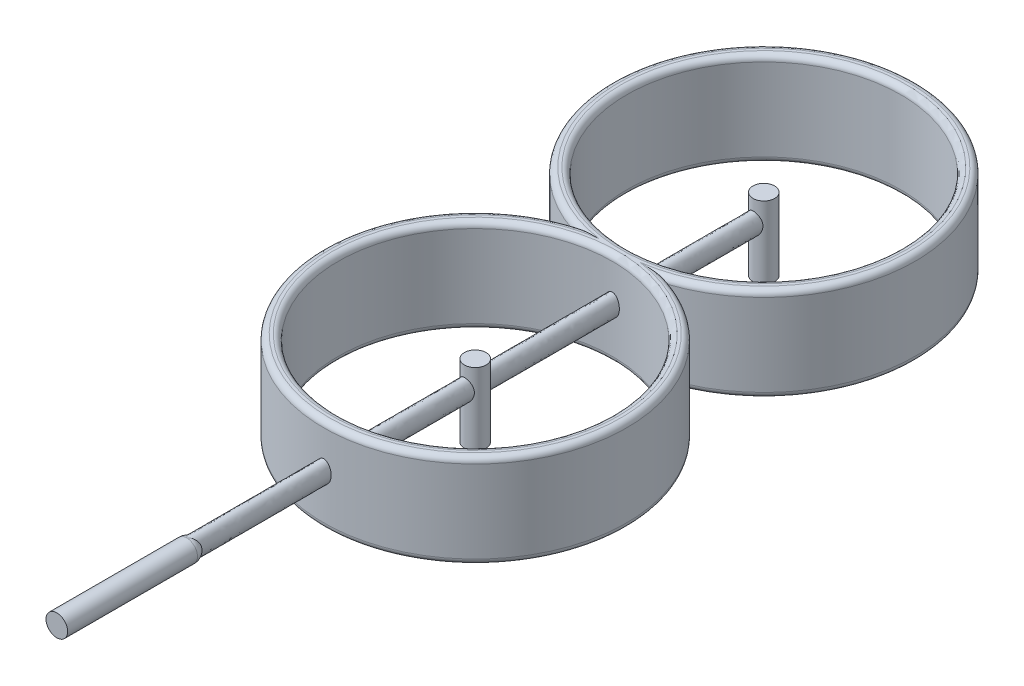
from build123d import *

# Parameters (mm, degrees)
SKETCH1_W           = 40
SKETCH1_H           = 60
BOSS_EXTRUDE1_DEPTH = 70
SKETCH2_R           = 7.5
BOSS_EXTRUDE2_DEPTH = 90
SKETCH3_RX          = 7.5
SKETCH3_RY          = 5
BOSS_EXTRUDE3_DEPTH = 400
SKETCH5_R           = 7.5
BOSS_EXTRUDE4_DEPTH = 50
SKETCH7_W           = 70
SKETCH7_H           = 60
CUT_EXTRUDE1_DEPTH  = 613.00490207


with BuildPart() as part:
    # Sketch1 → Boss-Extrude1 (new body)
    with BuildSketch(Plane.XY):
        with Locations((0, 30)):
            Rectangle(SKETCH1_W, SKETCH1_H)
    extrude(amount=BOSS_EXTRUDE1_DEPTH)

    # Sketch2 → Boss-Extrude2 (add)
    with BuildSketch(Plane(origin=(0, 0, 0), x_dir=(-1, 0, 0), z_dir=(0, 0, -1))):
        with Locations(Location((0, 40, 0), (0, 0, 180))):
            Circle(SKETCH2_R)
    extrude(amount=BOSS_EXTRUDE2_DEPTH)

    # Sketch3 → Boss-Extrude3 (add)
    with BuildSketch(Plane(origin=(0, 0, -90), x_dir=(-1, 0, 0), z_dir=(0, 0, -1))):
        with Locations(Location((0, 40), (0, 0, -90))):
            Ellipse(SKETCH3_RX, SKETCH3_RY)
    extrude(amount=BOSS_EXTRUDE3_DEPTH)

    # Sketch4 → Revolve1 (revolve)
    with BuildSketch(Plane(origin=(0, 0, 0), x_dir=(0, 0, -1), z_dir=(1, 0, 0))):
        with BuildLine():
            Line((97.5, 40), (90, 40))
            Line((90, 40), (90, 32.5))
            ThreePointArc((90, 32.5), (95.303300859, 34.696699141), (97.5, 40))
        make_face()
    revolve(axis=Axis((0, 40, -97.5), (0, 0, 1)))

    # Sketch5 → Boss-Extrude4 (add)
    with BuildSketch(Plane(origin=(0, 55, 0), x_dir=(1, 0, 0), z_dir=(0, 1, 0))):
        with Locations(Location((0, 290, 0), (0, 0, 180))):
            Circle(SKETCH5_R)
        with Locations(Location((0, 490, 0), (0, 0, 180))):
            Circle(SKETCH5_R)
    extrude(amount=-BOSS_EXTRUDE4_DEPTH)

    # Sketch6 → Revolve2 (revolve)
    with BuildSketch(Plane(origin=(0, 0, 0), x_dir=(0, 0, -1), z_dir=(1, 0, 0)), mode=Mode.PRIVATE) as revolve2_sk:
        with BuildLine():
            Line((389, 70), (391, 70))
            ThreePointArc((391, 70), (393.828427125, 68.828427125), (395, 66))
            Line((395, 66), (395, 9))
            ThreePointArc((395, 9), (393.828427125, 6.171572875), (391, 5))
            Line((391, 5), (389, 5))
            ThreePointArc((389, 5), (386.171572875, 6.171572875), (385, 9))
            Line((385, 9), (385, 66))
            ThreePointArc((385, 66), (386.171572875, 68.828427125), (389, 70))
        make_face()
    revolve(revolve2_sk.sketch.rotate(Axis((0, 5, -290), (0, 1, 0)), 270), axis=Axis((0, 5, -290), (0, 1, 0)))

    # Sketch6_2 → Revolve3 (revolve)
    with BuildSketch(Plane(origin=(0, 0, 0), x_dir=(0, 0, -1), z_dir=(1, 0, 0)), mode=Mode.PRIVATE) as revolve3_sk:
        with BuildLine():
            Line((389, 70), (391, 70))
            ThreePointArc((391, 70), (393.828427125, 68.828427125), (395, 66))
            Line((395, 66), (395, 9))
            ThreePointArc((395, 9), (393.828427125, 6.171572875), (391, 5))
            Line((391, 5), (389, 5))
            ThreePointArc((389, 5), (386.171572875, 6.171572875), (385, 9))
            Line((385, 9), (385, 66))
            ThreePointArc((385, 66), (386.171572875, 68.828427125), (389, 70))
        make_face()
    revolve(revolve3_sk.sketch.rotate(Axis((0, 5, -490), (0, 1, 0)), 90), axis=Axis((0, 5, -490), (0, 1, 0)))

    # Sketch7 → Cut-Extrude1 (cut, through all)
    with BuildSketch(Plane(origin=(20, 0, 0), x_dir=(0, 0, -1), z_dir=(1, 0, 0))):
        with Locations((-35, 30)):
            Rectangle(SKETCH7_W, SKETCH7_H)
    extrude(amount=-CUT_EXTRUDE1_DEPTH, mode=Mode.SUBTRACT)


solid = part.part
